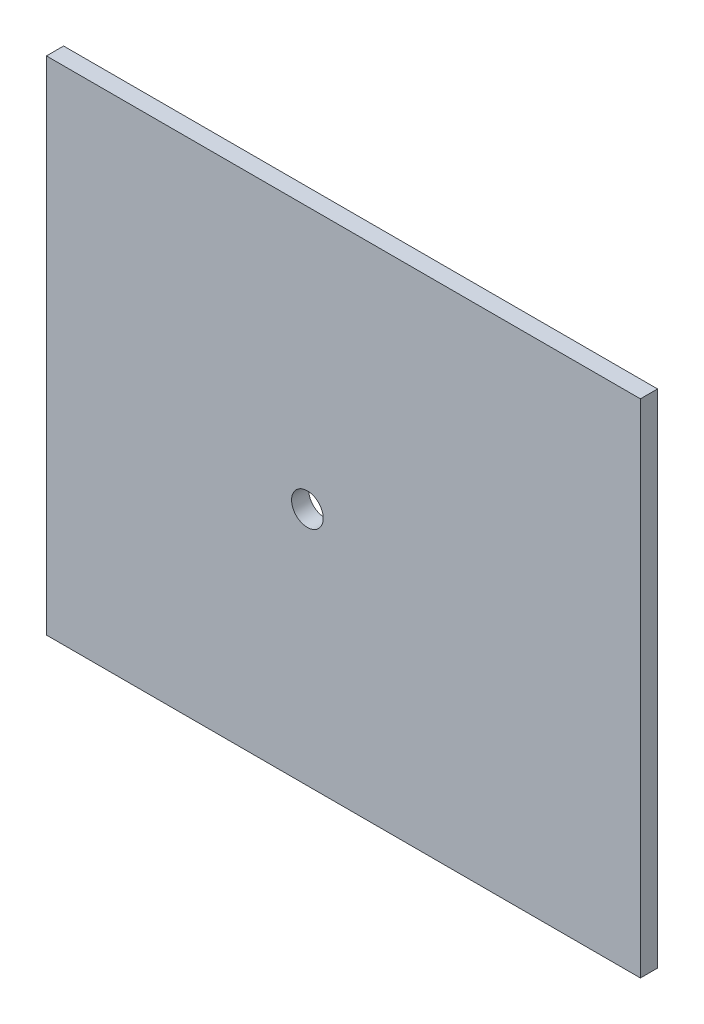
ISO-10303-21;
HEADER;
FILE_DESCRIPTION(('STEP AP214'),'2;1');
FILE_NAME('part.step','',(''),(''),'','','');
FILE_SCHEMA(('AUTOMOTIVE_DESIGN { 1 0 10303 214 1 1 1 1 }'));
ENDSEC;
DATA;
#1=APPLICATION_CONTEXT('core data for automotive mechanical design processes');
#2=APPLICATION_PROTOCOL_DEFINITION('international standard','automotive_design',2000,#1);
#3=PRODUCT_CONTEXT('',#1,'mechanical');
#4=PRODUCT('Part','Part','',(#3));
#5=PRODUCT_RELATED_PRODUCT_CATEGORY('part','',(#4));
#6=PRODUCT_DEFINITION_FORMATION('','',#4);
#7=PRODUCT_DEFINITION_CONTEXT('part definition',#1,'design');
#8=PRODUCT_DEFINITION('design','',#6,#7);
#9=PRODUCT_DEFINITION_SHAPE('','',#8);
#10=(LENGTH_UNIT() NAMED_UNIT(*) SI_UNIT(.MILLI.,.METRE.));
#11=(NAMED_UNIT(*) PLANE_ANGLE_UNIT() SI_UNIT($,.RADIAN.));
#12=(NAMED_UNIT(*) SI_UNIT($,.STERADIAN.) SOLID_ANGLE_UNIT());
#13=UNCERTAINTY_MEASURE_WITH_UNIT(LENGTH_MEASURE(1.E-05),#10,'distance_accuracy_value','');
#14=(GEOMETRIC_REPRESENTATION_CONTEXT(3) GLOBAL_UNCERTAINTY_ASSIGNED_CONTEXT((#13)) GLOBAL_UNIT_ASSIGNED_CONTEXT((#10,
#11,#12)) REPRESENTATION_CONTEXT('',''));
#15=CARTESIAN_POINT('',(0.,0.,0.));
#16=DIRECTION('',(0.,0.,1.));
#17=DIRECTION('',(1.,0.,0.));
#18=AXIS2_PLACEMENT_3D('',#15,#16,#17);
#19=CARTESIAN_POINT('',(0.,0.,1.3));
#20=DIRECTION('',(1.,0.,0.));
#21=DIRECTION('',(0.,0.,-1.));
#22=AXIS2_PLACEMENT_3D('',#19,#20,#21);
#23=PLANE('',#22);
#24=DIRECTION('',(0.,-1.,0.));
#25=VECTOR('',#24,1.);
#26=CARTESIAN_POINT('',(0.,0.,0.));
#27=LINE('',#26,#25);
#28=CARTESIAN_POINT('',(0.,38.,0.));
#29=VERTEX_POINT('',#28);
#30=CARTESIAN_POINT('',(0.,0.,0.));
#31=VERTEX_POINT('',#30);
#32=EDGE_CURVE('E71',#29,#31,#27,.T.);
#33=ORIENTED_EDGE('',*,*,#32,.T.);
#34=DIRECTION('',(0.,0.,-1.));
#35=VECTOR('',#34,1.);
#36=CARTESIAN_POINT('',(0.,0.,1.3));
#37=LINE('',#36,#35);
#38=CARTESIAN_POINT('',(0.,0.,1.3));
#39=VERTEX_POINT('',#38);
#40=EDGE_CURVE('E11',#39,#31,#37,.T.);
#41=ORIENTED_EDGE('',*,*,#40,.F.);
#42=DIRECTION('',(0.,-1.,0.));
#43=VECTOR('',#42,1.);
#44=CARTESIAN_POINT('',(0.,0.,1.3));
#45=LINE('',#44,#43);
#46=CARTESIAN_POINT('',(0.,38.,1.3));
#47=VERTEX_POINT('',#46);
#48=EDGE_CURVE('E94',#47,#39,#45,.T.);
#49=ORIENTED_EDGE('',*,*,#48,.F.);
#50=DIRECTION('',(0.,0.,-1.));
#51=VECTOR('',#50,1.);
#52=CARTESIAN_POINT('',(0.,38.,1.3));
#53=LINE('',#52,#51);
#54=EDGE_CURVE('E83',#47,#29,#53,.T.);
#55=ORIENTED_EDGE('',*,*,#54,.T.);
#56=EDGE_LOOP('',(#33,#41,#49,#55));
#57=FACE_BOUND('',#56,.T.);
#58=ADVANCED_FACE('F27',(#57),#23,.F.);
#59=CARTESIAN_POINT('',(0.,0.,1.3));
#60=DIRECTION('',(0.,1.,0.));
#61=DIRECTION('',(0.,0.,1.));
#62=AXIS2_PLACEMENT_3D('',#59,#60,#61);
#63=PLANE('',#62);
#64=DIRECTION('',(1.,0.,0.));
#65=VECTOR('',#64,1.);
#66=CARTESIAN_POINT('',(0.,0.,0.));
#67=LINE('',#66,#65);
#68=CARTESIAN_POINT('',(45.,0.,0.));
#69=VERTEX_POINT('',#68);
#70=EDGE_CURVE('E67',#31,#69,#67,.T.);
#71=ORIENTED_EDGE('',*,*,#70,.T.);
#72=DIRECTION('',(0.,0.,-1.));
#73=VECTOR('',#72,1.);
#74=CARTESIAN_POINT('',(45.,0.,1.3));
#75=LINE('',#74,#73);
#76=CARTESIAN_POINT('',(45.,0.,1.3));
#77=VERTEX_POINT('',#76);
#78=EDGE_CURVE('E34',#77,#69,#75,.T.);
#79=ORIENTED_EDGE('',*,*,#78,.F.);
#80=DIRECTION('',(1.,0.,0.));
#81=VECTOR('',#80,1.);
#82=CARTESIAN_POINT('',(0.,0.,1.3));
#83=LINE('',#82,#81);
#84=EDGE_CURVE('E79',#39,#77,#83,.T.);
#85=ORIENTED_EDGE('',*,*,#84,.F.);
#86=ORIENTED_EDGE('',*,*,#40,.T.);
#87=EDGE_LOOP('',(#71,#79,#85,#86));
#88=FACE_BOUND('',#87,.T.);
#89=ADVANCED_FACE('F78',(#88),#63,.F.);
#90=CARTESIAN_POINT('',(45.,0.,1.3));
#91=DIRECTION('',(-1.,0.,0.));
#92=DIRECTION('',(0.,0.,1.));
#93=AXIS2_PLACEMENT_3D('',#90,#91,#92);
#94=PLANE('',#93);
#95=DIRECTION('',(0.,1.,0.));
#96=VECTOR('',#95,1.);
#97=CARTESIAN_POINT('',(45.,0.,0.));
#98=LINE('',#97,#96);
#99=CARTESIAN_POINT('',(45.,38.,0.));
#100=VERTEX_POINT('',#99);
#101=EDGE_CURVE('E72',#69,#100,#98,.T.);
#102=ORIENTED_EDGE('',*,*,#101,.T.);
#103=DIRECTION('',(0.,0.,-1.));
#104=VECTOR('',#103,1.);
#105=CARTESIAN_POINT('',(45.,38.,1.3));
#106=LINE('',#105,#104);
#107=CARTESIAN_POINT('',(45.,38.,1.3));
#108=VERTEX_POINT('',#107);
#109=EDGE_CURVE('E100',#108,#100,#106,.T.);
#110=ORIENTED_EDGE('',*,*,#109,.F.);
#111=DIRECTION('',(0.,1.,0.));
#112=VECTOR('',#111,1.);
#113=CARTESIAN_POINT('',(45.,0.,1.3));
#114=LINE('',#113,#112);
#115=EDGE_CURVE('E46',#77,#108,#114,.T.);
#116=ORIENTED_EDGE('',*,*,#115,.F.);
#117=ORIENTED_EDGE('',*,*,#78,.T.);
#118=EDGE_LOOP('',(#102,#110,#116,#117));
#119=FACE_BOUND('',#118,.T.);
#120=ADVANCED_FACE('F103',(#119),#94,.F.);
#121=CARTESIAN_POINT('',(0.,38.,1.3));
#122=DIRECTION('',(0.,-1.,0.));
#123=DIRECTION('',(0.,0.,-1.));
#124=AXIS2_PLACEMENT_3D('',#121,#122,#123);
#125=PLANE('',#124);
#126=DIRECTION('',(-1.,0.,0.));
#127=VECTOR('',#126,1.);
#128=CARTESIAN_POINT('',(0.,38.,0.));
#129=LINE('',#128,#127);
#130=EDGE_CURVE('E92',#100,#29,#129,.T.);
#131=ORIENTED_EDGE('',*,*,#130,.T.);
#132=ORIENTED_EDGE('',*,*,#54,.F.);
#133=DIRECTION('',(-1.,0.,0.));
#134=VECTOR('',#133,1.);
#135=CARTESIAN_POINT('',(0.,38.,1.3));
#136=LINE('',#135,#134);
#137=EDGE_CURVE('E41',#108,#47,#136,.T.);
#138=ORIENTED_EDGE('',*,*,#137,.F.);
#139=ORIENTED_EDGE('',*,*,#109,.T.);
#140=EDGE_LOOP('',(#131,#132,#138,#139));
#141=FACE_BOUND('',#140,.T.);
#142=ADVANCED_FACE('F105',(#141),#125,.F.);
#143=CARTESIAN_POINT('',(0.,38.,1.3));
#144=DIRECTION('',(0.,0.,-1.));
#145=DIRECTION('',(-1.,0.,0.));
#146=AXIS2_PLACEMENT_3D('',#143,#144,#145);
#147=PLANE('',#146);
#148=CARTESIAN_POINT('',(19.7707697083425,18.1479820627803,1.3));
#149=DIRECTION('',(0.,0.,1.));
#150=DIRECTION('',(1.,0.,0.));
#151=AXIS2_PLACEMENT_3D('',#148,#149,#150);
#152=CIRCLE('',#151,1.2);
#153=CARTESIAN_POINT('',(20.9707697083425,18.1479820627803,1.3));
#154=VERTEX_POINT('',#153);
#155=EDGE_CURVE('E87',#154,#154,#152,.T.);
#156=ORIENTED_EDGE('',*,*,#155,.F.);
#157=EDGE_LOOP('',(#156));
#158=FACE_BOUND('',#157,.T.);
#159=ORIENTED_EDGE('',*,*,#48,.T.);
#160=ORIENTED_EDGE('',*,*,#84,.T.);
#161=ORIENTED_EDGE('',*,*,#115,.T.);
#162=ORIENTED_EDGE('',*,*,#137,.T.);
#163=EDGE_LOOP('',(#159,#160,#161,#162));
#164=FACE_BOUND('',#163,.T.);
#165=ADVANCED_FACE('F106',(#158,#164),#147,.F.);
#166=CARTESIAN_POINT('',(0.,38.,0.));
#167=DIRECTION('',(0.,0.,-1.));
#168=DIRECTION('',(-1.,0.,0.));
#169=AXIS2_PLACEMENT_3D('',#166,#167,#168);
#170=PLANE('',#169);
#171=CARTESIAN_POINT('',(19.7707697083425,18.1479820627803,0.));
#172=DIRECTION('',(0.,0.,1.));
#173=DIRECTION('',(1.,0.,0.));
#174=AXIS2_PLACEMENT_3D('',#171,#172,#173);
#175=CIRCLE('',#174,1.2);
#176=CARTESIAN_POINT('',(20.9707697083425,18.1479820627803,0.));
#177=VERTEX_POINT('',#176);
#178=EDGE_CURVE('E84',#177,#177,#175,.T.);
#179=ORIENTED_EDGE('',*,*,#178,.T.);
#180=EDGE_LOOP('',(#179));
#181=FACE_BOUND('',#180,.T.);
#182=ORIENTED_EDGE('',*,*,#32,.F.);
#183=ORIENTED_EDGE('',*,*,#130,.F.);
#184=ORIENTED_EDGE('',*,*,#101,.F.);
#185=ORIENTED_EDGE('',*,*,#70,.F.);
#186=EDGE_LOOP('',(#182,#183,#184,#185));
#187=FACE_BOUND('',#186,.T.);
#188=ADVANCED_FACE('F68',(#181,#187),#170,.T.);
#189=CARTESIAN_POINT('',(19.7707697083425,18.1479820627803,0.));
#190=DIRECTION('',(0.,0.,1.));
#191=DIRECTION('',(1.,0.,0.));
#192=AXIS2_PLACEMENT_3D('',#189,#190,#191);
#193=CYLINDRICAL_SURFACE('',#192,1.2);
#194=ORIENTED_EDGE('',*,*,#178,.F.);
#195=EDGE_LOOP('',(#194));
#196=FACE_BOUND('',#195,.T.);
#197=ORIENTED_EDGE('',*,*,#155,.T.);
#198=EDGE_LOOP('',(#197));
#199=FACE_BOUND('',#198,.T.);
#200=ADVANCED_FACE('F114',(#196,#199),#193,.F.);
#201=CLOSED_SHELL('',(#58,#89,#120,#142,#165,#188,#200));
#202=MANIFOLD_SOLID_BREP('B2',#201);
#203=ADVANCED_BREP_SHAPE_REPRESENTATION('',(#18,#202),#14);
#204=SHAPE_DEFINITION_REPRESENTATION(#9,#203);
ENDSEC;
END-ISO-10303-21;
